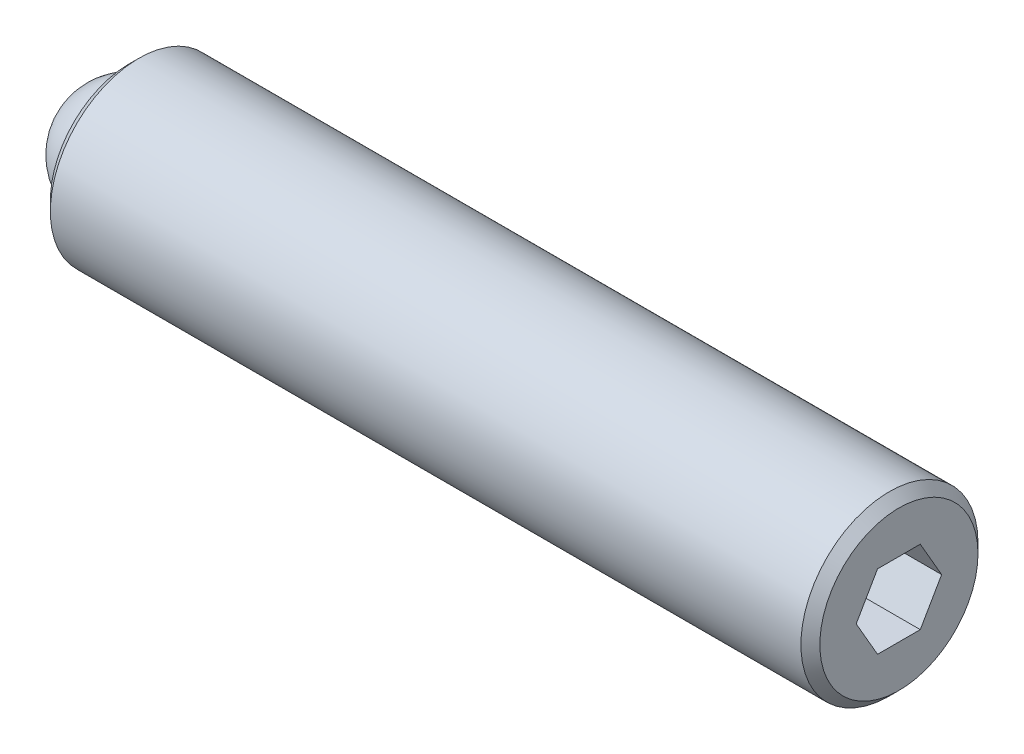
from build123d import *

# Parameters (mm, degrees)
SKETCH2_R           = 2.3749
BOSS_EXTRUDE1_DEPTH = 20.6375
CHAMFER1_SIZE       = 0.254
CHAMFER2_SIZE       = 0.254
CUT_EXTRUDE2_DEPTH  = 2.286
SKETCH3_R           = 1.5875
CUT_EXTRUDE3_DEPTH  = 1.5875


with BuildPart() as part:
    # Sketch2 → Boss-Extrude1 (new body)
    with BuildSketch(Plane(origin=(0, 0, 0), x_dir=(0, 0, -1), z_dir=(1, 0, 0))):
        Circle(SKETCH2_R)
    extrude(amount=BOSS_EXTRUDE1_DEPTH)

    # Chamfer1
    chamfer1_edges = [part.edges().sort_by_distance(p)[0] for p in [
        (0, 0, 2.3749),
    ]]
    chamfer(chamfer1_edges, length=CHAMFER1_SIZE)

    # Chamfer2
    chamfer2_edges = [part.edges().sort_by_distance(p)[0] for p in [
        (20.6375, 0, 2.3749),
    ]]
    chamfer(chamfer2_edges, length=CHAMFER2_SIZE)

    # Sketch4 → Cut-Extrude2 (cut)
    with BuildSketch(Plane(origin=(20.6375, 0, 0), x_dir=(0, 0, -1), z_dir=(1, 0, 0))):
        Polygon((1.14567944, 0), (0.57283972, 0.9921875), (-0.57283972, 0.9921875), (-1.14567944, 0), (-0.57283972, -0.9921875), (0.57283972, -0.9921875), align=None)
    extrude(amount=-CUT_EXTRUDE2_DEPTH, mode=Mode.SUBTRACT)

    # Sketch3 → Cut-Extrude3 (cut)
    with BuildSketch(Plane.ZY):
        Circle(SKETCH3_R)
    extrude(amount=-CUT_EXTRUDE3_DEPTH, mode=Mode.SUBTRACT)


with BuildPart() as body_2:
    # Sketch5 → Revolve1 (revolve)
    with BuildSketch(Plane.ZY):
        with BuildLine():
            Line((0, 0), (0, -1.5875))
            ThreePointArc((0, -1.5875), (-1.5875, 0), (0, 1.5875))
            Line((0, 1.5875), (0, 0))
        make_face()
    revolve(axis=Axis((0, 0, 0), (0, 1, 0)))


solid = Compound([part.part, body_2.part])
